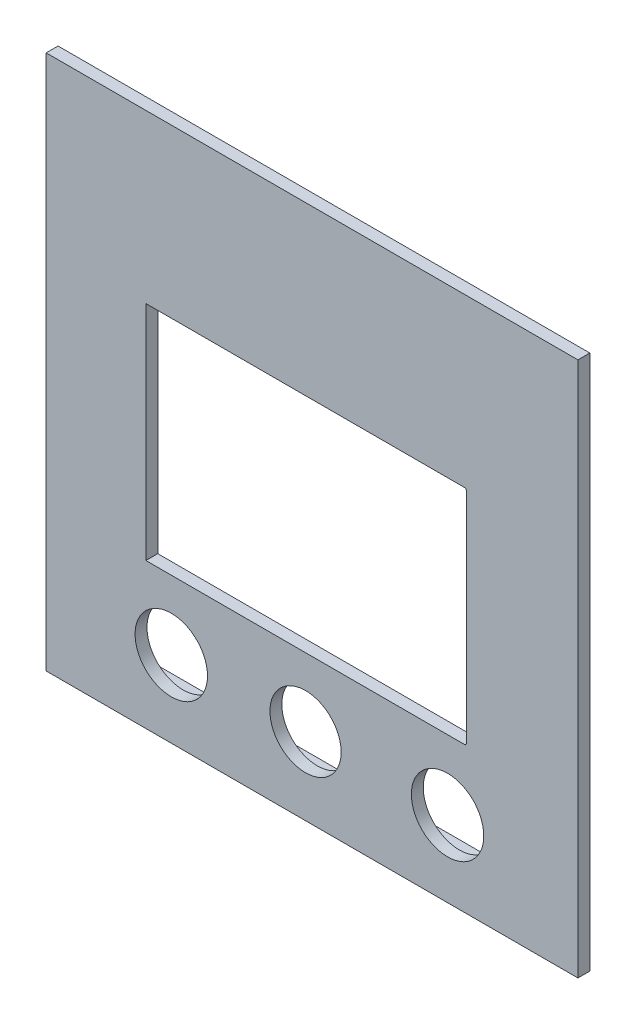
from build123d import *

# Parameters (mm, degrees)
SKETCH1_W           = 81.6
SKETCH1_H           = 82.2
SKETCH1_R           = 1
SKETCH1_R_2         = 6.1
SKETCH1_W_2         = 54.4
SKETCH1_H_2         = 37.5
BOSS_EXTRUDE1_DEPTH = 2
FILLET1_R           = 0.3
SKETCH2_W           = 82
SKETCH2_H           = 82.6
SKETCH2_W_2         = 79.2
SKETCH2_H_2         = 79.8
BOSS_EXTRUDE2_DEPTH = 3
SKETCH3_R           = 6
CUT_EXTRUDE1_DEPTH  = 3
SKETCH4_R           = 8.17705111
SKETCH4_R_2         = 6
BOSS_EXTRUDE3_DEPTH = 2
SKETCH5_W           = 89.6
SKETCH5_H           = 90.2
SKETCH5_W_2         = 81.6
SKETCH5_H_2         = 82.2
BOSS_EXTRUDE4_DEPTH = 2
SKETCH6_W           = 0.654271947
SKETCH6_H           = 38.113717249
BOSS_EXTRUDE5_DEPTH = 2


with BuildPart() as part:
    # Sketch1 → Boss-Extrude1 (new body)
    with BuildSketch(Plane.XY):
        with Locations((-68.175, -59.344211)):
            Rectangle(SKETCH1_W, SKETCH1_H)
        with Locations((-69.468414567, -91.880172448)):
            Circle(SKETCH1_R, mode=Mode.SUBTRACT)
        with Locations((-45.345134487, -91.653485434)):
            Circle(SKETCH1_R_2, mode=Mode.SUBTRACT)
        with Locations((-91.893304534, -91.57750339)):
            Circle(SKETCH1_R_2, mode=Mode.SUBTRACT)
        with BuildLine():
            ThreePointArc((-61.900884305, -92.581945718), (-61.868414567, -91.880172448), (-61.900884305, -91.178399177))
            Line((-61.900884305, -91.178399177), (-64.517908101, -91.178399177))
            ThreePointArc((-64.517908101, -91.178399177), (-64.468414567, -91.880172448), (-64.517908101, -92.581945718))
            Line((-64.517908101, -92.581945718), (-61.900884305, -92.581945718))
        make_face(mode=Mode.SUBTRACT)
        with BuildLine():
            ThreePointArc((-77.03594483, -91.178399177), (-77.068414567, -91.880172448), (-77.03594483, -92.581945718))
            Line((-77.03594483, -92.581945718), (-74.418921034, -92.581945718))
            ThreePointArc((-74.418921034, -92.581945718), (-74.468414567, -91.880172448), (-74.418921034, -91.178399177))
            Line((-74.418921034, -91.178399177), (-77.03594483, -91.178399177))
        make_face(mode=Mode.SUBTRACT)
        with Locations((-69.375, -61.174211)):
            Rectangle(SKETCH1_W_2, SKETCH1_H_2, mode=Mode.SUBTRACT)
        with BuildLine():
            Line((-68.781157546, -86.92762989), (-68.781157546, -84.395858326))
            Line((-68.781157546, -84.395858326), (-70.155671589, -84.395858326))
            Line((-70.155671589, -84.395858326), (-70.155671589, -86.92762989))
            ThreePointArc((-70.155671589, -86.92762989), (-69.468414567, -86.880172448), (-68.781157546, -86.92762989))
        make_face(mode=Mode.SUBTRACT)
        with BuildLine():
            Line((-70.155671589, -99.364486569), (-70.155671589, -96.832715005))
            ThreePointArc((-70.155671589, -96.832715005), (-69.468414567, -96.880172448), (-68.781157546, -96.832715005))
            Line((-68.781157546, -96.832715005), (-68.781157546, -99.364486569))
            Line((-68.781157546, -99.364486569), (-70.155671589, -99.364486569))
        make_face(mode=Mode.SUBTRACT)
    extrude(amount=BOSS_EXTRUDE1_DEPTH)

    # Fillet1
    fillet1_edges = [part.edges().sort_by_distance(p)[0] for p in [
        (-42.175, -42.424211, 1),
        (-96.575, -42.424211, 1),
        (-96.575, -79.924211, 1),
        (-42.175, -79.924211, 1),
    ]]
    fillet(fillet1_edges, radius=FILLET1_R)

    # Sketch2 → Boss-Extrude2 (add)
    with BuildSketch(Plane(origin=(0, 0, 0), x_dir=(-1, 0, 0), z_dir=(0, 0, -1))):
        with Locations((68.175, -59.344211)):
            Rectangle(SKETCH2_W, SKETCH2_H)
        with Locations((68.175, -59.344211)):
            Rectangle(SKETCH2_W_2, SKETCH2_H_2, mode=Mode.SUBTRACT)
    extrude(amount=BOSS_EXTRUDE2_DEPTH)

    # Sketch3 → Cut-Extrude1 (cut)
    with BuildSketch(Plane.XY.offset(2)):
        with Locations((-69.275, -91.444211)):
            Circle(SKETCH3_R)
    extrude(amount=-CUT_EXTRUDE1_DEPTH, mode=Mode.SUBTRACT)

    # Sketch4 → Boss-Extrude3 (add)
    with BuildSketch(Plane.XY.offset(2)):
        with Locations((-69.275, -91.444211)):
            Circle(SKETCH4_R)
        with Locations((-69.275, -91.444211)):
            Circle(SKETCH4_R_2, mode=Mode.SUBTRACT)
    extrude(amount=-BOSS_EXTRUDE3_DEPTH)

    # Sketch5 → Boss-Extrude4 (add)
    with BuildSketch(Plane.XY.offset(2)):
        with Locations((-68.175, -59.344211)):
            Rectangle(SKETCH5_W, SKETCH5_H)
        with Locations((-68.175, -59.344211)):
            Rectangle(SKETCH5_W_2, SKETCH5_H_2, mode=Mode.SUBTRACT)
    extrude(amount=-BOSS_EXTRUDE4_DEPTH)

    # Sketch6 → Boss-Extrude5 (add)
    with BuildSketch(Plane.XY.offset(2)):
        with Locations((-96.502135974, -61.481069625)):
            Rectangle(SKETCH6_W, SKETCH6_H)
    extrude(amount=-BOSS_EXTRUDE5_DEPTH)


solid = part.part
